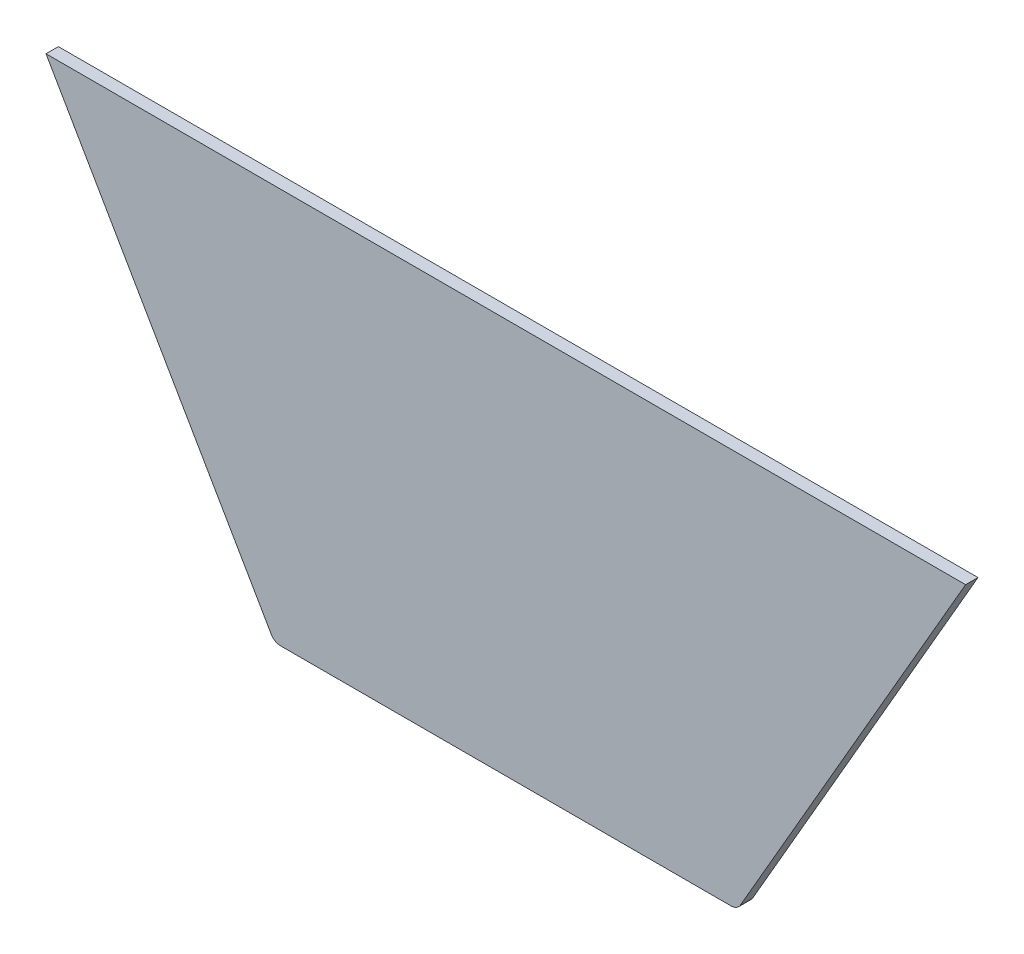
from build123d import *

# Parameters (mm, degrees)
EXTRUDE1_DEPTH = 5.08
SHELL1_T       = -2.54


with BuildPart() as part:
    # Sketch1 → Extrude1 (new body)
    with BuildSketch(Plane.XY):
        with BuildLine():
            Line((-189.252335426, -0.642298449), (187.996990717, -0.642298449))
            Line((187.996990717, -0.642298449), (95.609400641, -160.662298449))
            ThreePointArc((95.609400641, -160.662298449), (93.982417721, -162.289281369), (91.759917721, -162.884798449))
            Line((91.759917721, -162.884798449), (-93.01526243, -162.884798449))
            ThreePointArc((-93.01526243, -162.884798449), (-95.23776243, -162.289281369), (-96.86474535, -160.662298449))
            Line((-96.86474535, -160.662298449), (-189.252335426, -0.642298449))
        make_face()
    extrude(amount=EXTRUDE1_DEPTH)

    # Shell1
    shell1_openings = [part.faces().sort_by_distance(p)[0] for p in [
        (-0.627672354, -72.827510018, 0),
    ]]
    offset(amount=SHELL1_T, openings=shell1_openings, kind=Kind.INTERSECTION)


solid = part.part
